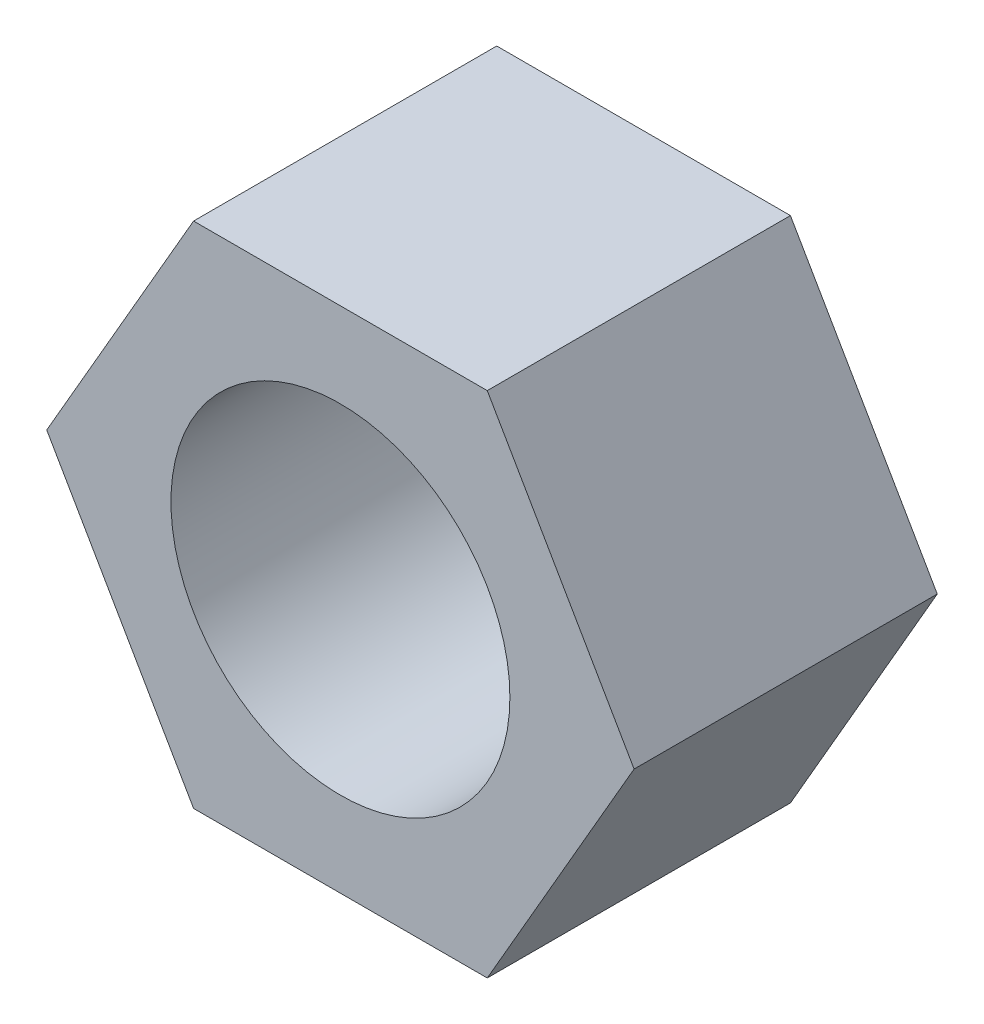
from build123d import *

# Parameters (mm, degrees)
EXTRUDE1_DEPTH     = 14.1986
SKETCH2_R          = 7.9375
CUT_EXTRUDE1_DEPTH = 24.079981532


with BuildPart() as part:
    # Sketch1 → Extrude1 (new body)
    with BuildSketch(Plane.XY):
        Polygon((6.877465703, 11.9126), (-6.877465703, 11.9126), (-13.7541, 0), (-6.877465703, -11.9126), (6.877465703, -11.9126), (13.7541, 0), align=None)
    extrude(amount=EXTRUDE1_DEPTH)

    # Sketch2 → Cut-Extrude1 (cut, through all)
    with BuildSketch(Plane.XY.offset(14.1986)):
        Circle(SKETCH2_R)
    extrude(amount=-CUT_EXTRUDE1_DEPTH, mode=Mode.SUBTRACT)


solid = part.part
